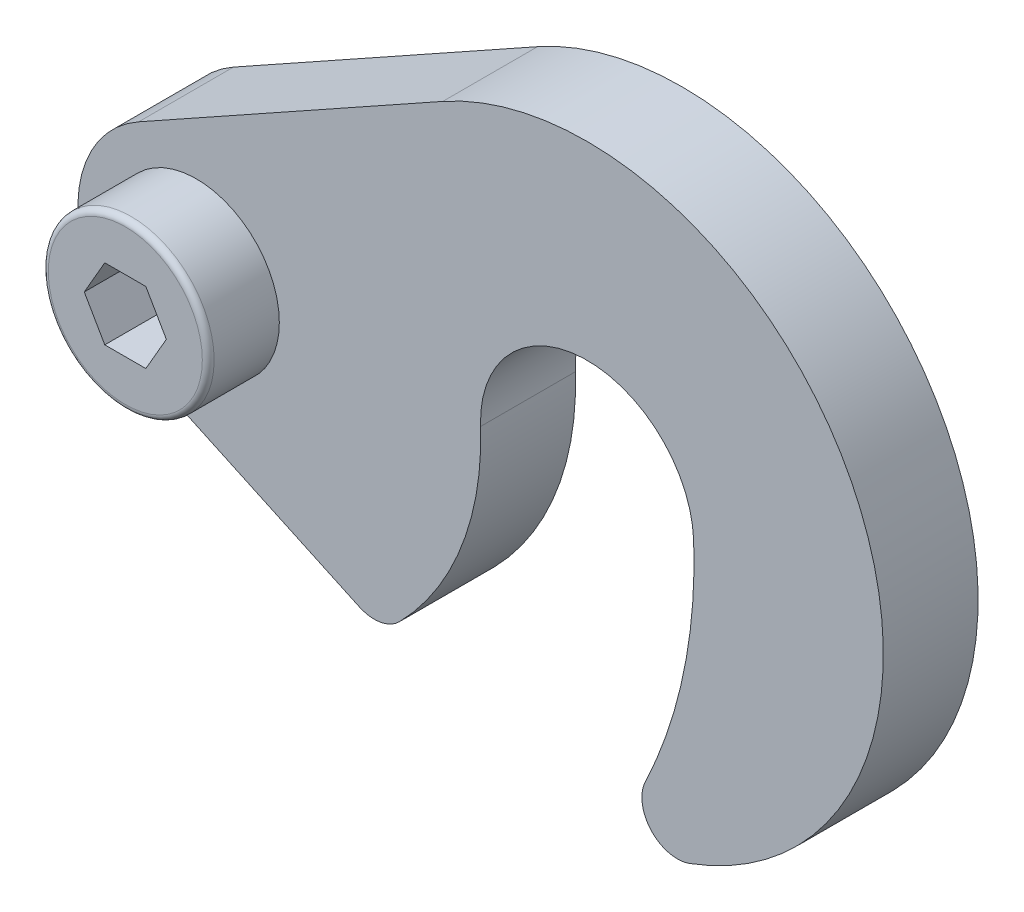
ISO-10303-21;
HEADER;
FILE_DESCRIPTION(('STEP AP214'),'2;1');
FILE_NAME('part.step','',(''),(''),'','','');
FILE_SCHEMA(('AUTOMOTIVE_DESIGN { 1 0 10303 214 1 1 1 1 }'));
ENDSEC;
DATA;
#1=APPLICATION_CONTEXT('core data for automotive mechanical design processes');
#2=APPLICATION_PROTOCOL_DEFINITION('international standard','automotive_design',2000,#1);
#3=PRODUCT_CONTEXT('',#1,'mechanical');
#4=PRODUCT('Part','Part','',(#3));
#5=PRODUCT_RELATED_PRODUCT_CATEGORY('part','',(#4));
#6=PRODUCT_DEFINITION_FORMATION('','',#4);
#7=PRODUCT_DEFINITION_CONTEXT('part definition',#1,'design');
#8=PRODUCT_DEFINITION('design','',#6,#7);
#9=PRODUCT_DEFINITION_SHAPE('','',#8);
#10=(LENGTH_UNIT() NAMED_UNIT(*) SI_UNIT(.MILLI.,.METRE.));
#11=(NAMED_UNIT(*) PLANE_ANGLE_UNIT() SI_UNIT($,.RADIAN.));
#12=(NAMED_UNIT(*) SI_UNIT($,.STERADIAN.) SOLID_ANGLE_UNIT());
#13=UNCERTAINTY_MEASURE_WITH_UNIT(LENGTH_MEASURE(1.E-05),#10,'distance_accuracy_value','');
#14=(GEOMETRIC_REPRESENTATION_CONTEXT(3) GLOBAL_UNCERTAINTY_ASSIGNED_CONTEXT((#13)) GLOBAL_UNIT_ASSIGNED_CONTEXT((#10,
#11,#12)) REPRESENTATION_CONTEXT('',''));
#15=CARTESIAN_POINT('',(0.,0.,0.));
#16=DIRECTION('',(0.,0.,1.));
#17=DIRECTION('',(1.,0.,0.));
#18=AXIS2_PLACEMENT_3D('',#15,#16,#17);
#19=CARTESIAN_POINT('',(0.,0.,1.));
#20=DIRECTION('',(0.,0.,1.));
#21=DIRECTION('',(0.,-1.,0.));
#22=AXIS2_PLACEMENT_3D('',#19,#20,#21);
#23=PLANE('',#22);
#24=CARTESIAN_POINT('',(0.,0.,1.));
#25=DIRECTION('',(0.,0.,-1.));
#26=DIRECTION('',(0.,1.,0.));
#27=AXIS2_PLACEMENT_3D('',#24,#25,#26);
#28=CIRCLE('',#27,5.25);
#29=CARTESIAN_POINT('',(0.,5.25,1.));
#30=VERTEX_POINT('',#29);
#31=EDGE_CURVE('E179',#30,#30,#28,.T.);
#32=ORIENTED_EDGE('',*,*,#31,.F.);
#33=EDGE_LOOP('',(#32));
#34=FACE_BOUND('',#33,.T.);
#35=CARTESIAN_POINT('',(0.,0.,1.));
#36=DIRECTION('',(0.,0.,1.));
#37=DIRECTION('',(0.,-1.,0.));
#38=AXIS2_PLACEMENT_3D('',#35,#36,#37);
#39=CIRCLE('',#38,42.);
#40=CARTESIAN_POINT('',(37.8913046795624,-18.1176441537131,1.));
#41=VERTEX_POINT('',#40);
#42=CARTESIAN_POINT('',(41.9709947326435,1.5606412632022,1.));
#43=VERTEX_POINT('',#42);
#44=EDGE_CURVE('E193',#41,#43,#39,.T.);
#45=ORIENTED_EDGE('',*,*,#44,.T.);
#46=CARTESIAN_POINT('',(32.9772101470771,1.22621813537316,1.));
#47=DIRECTION('',(0.,0.,1.));
#48=DIRECTION('',(0.,-1.,0.));
#49=AXIS2_PLACEMENT_3D('',#46,#47,#48);
#50=CIRCLE('',#49,9.);
#51=CARTESIAN_POINT('',(23.9834255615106,0.891795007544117,1.));
#52=VERTEX_POINT('',#51);
#53=EDGE_CURVE('E198',#43,#52,#50,.T.);
#54=ORIENTED_EDGE('',*,*,#53,.T.);
#55=CARTESIAN_POINT('',(0.,0.,1.));
#56=DIRECTION('',(0.,0.,1.));
#57=DIRECTION('',(0.,-1.,0.));
#58=AXIS2_PLACEMENT_3D('',#55,#56,#57);
#59=CIRCLE('',#58,24.);
#60=CARTESIAN_POINT('',(17.1539610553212,-16.7851607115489,1.));
#61=VERTEX_POINT('',#60);
#62=EDGE_CURVE('E201',#61,#52,#59,.T.);
#63=ORIENTED_EDGE('',*,*,#62,.F.);
#64=CARTESIAN_POINT('',(15.0097159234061,-14.6870156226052,1.));
#65=DIRECTION('',(0.,0.,1.));
#66=DIRECTION('',(0.,-1.,0.));
#67=AXIS2_PLACEMENT_3D('',#64,#65,#66);
#68=CIRCLE('',#67,3.);
#69=CARTESIAN_POINT('',(13.746314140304,-17.4080110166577,1.));
#70=VERTEX_POINT('',#69);
#71=EDGE_CURVE('E204',#70,#61,#68,.T.);
#72=ORIENTED_EDGE('',*,*,#71,.F.);
#73=DIRECTION('',(-0.906998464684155,0.421133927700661,0.));
#74=VECTOR('',#73,1.);
#75=CARTESIAN_POINT('',(13.746314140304,-17.4080110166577,1.));
#76=LINE('',#75,#74);
#77=CARTESIAN_POINT('',(-4.21133927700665,-9.06998464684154,1.));
#78=VERTEX_POINT('',#77);
#79=EDGE_CURVE('E207',#70,#78,#76,.T.);
#80=ORIENTED_EDGE('',*,*,#79,.T.);
#81=CARTESIAN_POINT('',(0.,0.,1.));
#82=DIRECTION('',(0.,0.,1.));
#83=DIRECTION('',(0.,-1.,0.));
#84=AXIS2_PLACEMENT_3D('',#81,#82,#83);
#85=CIRCLE('',#84,10.);
#86=CARTESIAN_POINT('',(-4.87329161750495,8.7321835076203,1.));
#87=VERTEX_POINT('',#86);
#88=EDGE_CURVE('E210',#87,#78,#85,.T.);
#89=ORIENTED_EDGE('',*,*,#88,.F.);
#90=DIRECTION('',(0.873218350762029,0.487329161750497,0.));
#91=VECTOR('',#90,1.);
#92=CARTESIAN_POINT('',(-4.87329161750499,8.73218350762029,1.));
#93=LINE('',#92,#91);
#94=CARTESIAN_POINT('',(20.7939811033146,23.0566769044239,1.));
#95=VERTEX_POINT('',#94);
#96=EDGE_CURVE('E213',#87,#95,#93,.T.);
#97=ORIENTED_EDGE('',*,*,#96,.T.);
#98=CARTESIAN_POINT('',(32.9772101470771,1.22621813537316,1.));
#99=DIRECTION('',(0.,0.,1.));
#100=DIRECTION('',(0.,-1.,0.));
#101=AXIS2_PLACEMENT_3D('',#98,#99,#100);
#102=CIRCLE('',#101,25.);
#103=CARTESIAN_POINT('',(41.6370013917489,-22.22603155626,1.));
#104=VERTEX_POINT('',#103);
#105=EDGE_CURVE('E216',#104,#95,#102,.T.);
#106=ORIENTED_EDGE('',*,*,#105,.F.);
#107=CARTESIAN_POINT('',(40.5978264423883,-19.411761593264,1.));
#108=DIRECTION('',(0.,0.,-1.));
#109=DIRECTION('',(0.,1.,0.));
#110=AXIS2_PLACEMENT_3D('',#107,#108,#109);
#111=CIRCLE('',#110,3.);
#112=EDGE_CURVE('E219',#104,#41,#111,.T.);
#113=ORIENTED_EDGE('',*,*,#112,.T.);
#114=EDGE_LOOP('',(#45,#54,#63,#72,#80,#89,#97,#106,#113));
#115=FACE_BOUND('',#114,.T.);
#116=ADVANCED_FACE('F14',(#34,#115),#23,.F.);
#117=CARTESIAN_POINT('',(0.,0.,9.));
#118=DIRECTION('',(0.,0.,-1.));
#119=DIRECTION('',(0.,1.,0.));
#120=AXIS2_PLACEMENT_3D('',#117,#118,#119);
#121=CYLINDRICAL_SURFACE('',#120,42.);
#122=DIRECTION('',(0.,0.,-1.));
#123=VECTOR('',#122,1.);
#124=CARTESIAN_POINT('',(37.8913046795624,-18.1176441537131,9.));
#125=LINE('',#124,#123);
#126=CARTESIAN_POINT('',(37.8913046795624,-18.1176441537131,9.));
#127=VERTEX_POINT('',#126);
#128=EDGE_CURVE('E37',#127,#41,#125,.T.);
#129=ORIENTED_EDGE('',*,*,#128,.F.);
#130=CARTESIAN_POINT('',(0.,0.,9.));
#131=DIRECTION('',(0.,0.,1.));
#132=DIRECTION('',(0.,-1.,0.));
#133=AXIS2_PLACEMENT_3D('',#130,#131,#132);
#134=CIRCLE('',#133,42.);
#135=CARTESIAN_POINT('',(41.9709947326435,1.5606412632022,9.));
#136=VERTEX_POINT('',#135);
#137=EDGE_CURVE('E222',#127,#136,#134,.T.);
#138=ORIENTED_EDGE('',*,*,#137,.T.);
#139=DIRECTION('',(0.,0.,-1.));
#140=VECTOR('',#139,1.);
#141=CARTESIAN_POINT('',(41.9709947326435,1.5606412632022,9.));
#142=LINE('',#141,#140);
#143=EDGE_CURVE('E248',#136,#43,#142,.T.);
#144=ORIENTED_EDGE('',*,*,#143,.T.);
#145=ORIENTED_EDGE('',*,*,#44,.F.);
#146=EDGE_LOOP('',(#129,#138,#144,#145));
#147=FACE_BOUND('',#146,.T.);
#148=ADVANCED_FACE('F284',(#147),#121,.F.);
#149=CARTESIAN_POINT('',(40.5978264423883,-19.411761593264,9.));
#150=DIRECTION('',(0.,0.,-1.));
#151=DIRECTION('',(0.,1.,0.));
#152=AXIS2_PLACEMENT_3D('',#149,#150,#151);
#153=CYLINDRICAL_SURFACE('',#152,3.);
#154=DIRECTION('',(0.,0.,-1.));
#155=VECTOR('',#154,1.);
#156=CARTESIAN_POINT('',(41.6370013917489,-22.22603155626,9.));
#157=LINE('',#156,#155);
#158=CARTESIAN_POINT('',(41.6370013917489,-22.22603155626,9.));
#159=VERTEX_POINT('',#158);
#160=EDGE_CURVE('E262',#159,#104,#157,.T.);
#161=ORIENTED_EDGE('',*,*,#160,.F.);
#162=CARTESIAN_POINT('',(40.5978264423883,-19.411761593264,9.));
#163=DIRECTION('',(0.,0.,-1.));
#164=DIRECTION('',(0.,1.,0.));
#165=AXIS2_PLACEMENT_3D('',#162,#163,#164);
#166=CIRCLE('',#165,3.);
#167=EDGE_CURVE('E245',#159,#127,#166,.T.);
#168=ORIENTED_EDGE('',*,*,#167,.T.);
#169=ORIENTED_EDGE('',*,*,#128,.T.);
#170=ORIENTED_EDGE('',*,*,#112,.F.);
#171=EDGE_LOOP('',(#161,#168,#169,#170));
#172=FACE_BOUND('',#171,.T.);
#173=ADVANCED_FACE('F291',(#172),#153,.T.);
#174=CARTESIAN_POINT('',(32.9772101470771,1.22621813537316,9.));
#175=DIRECTION('',(0.,0.,-1.));
#176=DIRECTION('',(0.,1.,0.));
#177=AXIS2_PLACEMENT_3D('',#174,#175,#176);
#178=CYLINDRICAL_SURFACE('',#177,25.);
#179=DIRECTION('',(0.,0.,-1.));
#180=VECTOR('',#179,1.);
#181=CARTESIAN_POINT('',(20.7939811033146,23.0566769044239,9.));
#182=LINE('',#181,#180);
#183=CARTESIAN_POINT('',(20.7939811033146,23.0566769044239,9.));
#184=VERTEX_POINT('',#183);
#185=EDGE_CURVE('E260',#184,#95,#182,.T.);
#186=ORIENTED_EDGE('',*,*,#185,.F.);
#187=CARTESIAN_POINT('',(32.9772101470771,1.22621813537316,9.));
#188=DIRECTION('',(0.,0.,1.));
#189=DIRECTION('',(0.,-1.,0.));
#190=AXIS2_PLACEMENT_3D('',#187,#188,#189);
#191=CIRCLE('',#190,25.);
#192=EDGE_CURVE('E242',#159,#184,#191,.T.);
#193=ORIENTED_EDGE('',*,*,#192,.F.);
#194=ORIENTED_EDGE('',*,*,#160,.T.);
#195=ORIENTED_EDGE('',*,*,#105,.T.);
#196=EDGE_LOOP('',(#186,#193,#194,#195));
#197=FACE_BOUND('',#196,.T.);
#198=ADVANCED_FACE('F327',(#197),#178,.T.);
#199=CARTESIAN_POINT('',(-4.87329161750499,8.73218350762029,9.));
#200=DIRECTION('',(-0.487329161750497,0.873218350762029,0.));
#201=DIRECTION('',(-0.873218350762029,-0.487329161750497,0.));
#202=AXIS2_PLACEMENT_3D('',#199,#200,#201);
#203=PLANE('',#202);
#204=DIRECTION('',(0.,0.,-1.));
#205=VECTOR('',#204,1.);
#206=CARTESIAN_POINT('',(-4.87329161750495,8.7321835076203,9.));
#207=LINE('',#206,#205);
#208=CARTESIAN_POINT('',(-4.87329161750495,8.7321835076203,9.));
#209=VERTEX_POINT('',#208);
#210=EDGE_CURVE('E258',#209,#87,#207,.T.);
#211=ORIENTED_EDGE('',*,*,#210,.F.);
#212=DIRECTION('',(0.873218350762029,0.487329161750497,0.));
#213=VECTOR('',#212,1.);
#214=CARTESIAN_POINT('',(-4.87329161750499,8.73218350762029,9.));
#215=LINE('',#214,#213);
#216=EDGE_CURVE('E239',#209,#184,#215,.T.);
#217=ORIENTED_EDGE('',*,*,#216,.T.);
#218=ORIENTED_EDGE('',*,*,#185,.T.);
#219=ORIENTED_EDGE('',*,*,#96,.F.);
#220=EDGE_LOOP('',(#211,#217,#218,#219));
#221=FACE_BOUND('',#220,.T.);
#222=ADVANCED_FACE('F323',(#221),#203,.T.);
#223=CARTESIAN_POINT('',(0.,0.,9.));
#224=DIRECTION('',(0.,0.,-1.));
#225=DIRECTION('',(0.,1.,0.));
#226=AXIS2_PLACEMENT_3D('',#223,#224,#225);
#227=CYLINDRICAL_SURFACE('',#226,10.);
#228=DIRECTION('',(0.,0.,-1.));
#229=VECTOR('',#228,1.);
#230=CARTESIAN_POINT('',(-4.21133927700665,-9.06998464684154,9.));
#231=LINE('',#230,#229);
#232=CARTESIAN_POINT('',(-4.21133927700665,-9.06998464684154,9.));
#233=VERTEX_POINT('',#232);
#234=EDGE_CURVE('E256',#233,#78,#231,.T.);
#235=ORIENTED_EDGE('',*,*,#234,.F.);
#236=CARTESIAN_POINT('',(0.,0.,9.));
#237=DIRECTION('',(0.,0.,1.));
#238=DIRECTION('',(0.,-1.,0.));
#239=AXIS2_PLACEMENT_3D('',#236,#237,#238);
#240=CIRCLE('',#239,10.);
#241=EDGE_CURVE('E236',#209,#233,#240,.T.);
#242=ORIENTED_EDGE('',*,*,#241,.F.);
#243=ORIENTED_EDGE('',*,*,#210,.T.);
#244=ORIENTED_EDGE('',*,*,#88,.T.);
#245=EDGE_LOOP('',(#235,#242,#243,#244));
#246=FACE_BOUND('',#245,.T.);
#247=ADVANCED_FACE('F319',(#246),#227,.T.);
#248=CARTESIAN_POINT('',(13.746314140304,-17.4080110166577,9.));
#249=DIRECTION('',(-0.421133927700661,-0.906998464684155,0.));
#250=DIRECTION('',(0.906998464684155,-0.421133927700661,0.));
#251=AXIS2_PLACEMENT_3D('',#248,#249,#250);
#252=PLANE('',#251);
#253=DIRECTION('',(0.,0.,-1.));
#254=VECTOR('',#253,1.);
#255=CARTESIAN_POINT('',(13.746314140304,-17.4080110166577,9.));
#256=LINE('',#255,#254);
#257=CARTESIAN_POINT('',(13.746314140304,-17.4080110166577,9.));
#258=VERTEX_POINT('',#257);
#259=EDGE_CURVE('E254',#258,#70,#256,.T.);
#260=ORIENTED_EDGE('',*,*,#259,.F.);
#261=DIRECTION('',(-0.906998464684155,0.421133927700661,0.));
#262=VECTOR('',#261,1.);
#263=CARTESIAN_POINT('',(13.746314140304,-17.4080110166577,9.));
#264=LINE('',#263,#262);
#265=EDGE_CURVE('E233',#258,#233,#264,.T.);
#266=ORIENTED_EDGE('',*,*,#265,.T.);
#267=ORIENTED_EDGE('',*,*,#234,.T.);
#268=ORIENTED_EDGE('',*,*,#79,.F.);
#269=EDGE_LOOP('',(#260,#266,#267,#268));
#270=FACE_BOUND('',#269,.T.);
#271=ADVANCED_FACE('F315',(#270),#252,.T.);
#272=CARTESIAN_POINT('',(15.0097159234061,-14.6870156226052,9.));
#273=DIRECTION('',(0.,0.,-1.));
#274=DIRECTION('',(0.,1.,0.));
#275=AXIS2_PLACEMENT_3D('',#272,#273,#274);
#276=CYLINDRICAL_SURFACE('',#275,3.);
#277=DIRECTION('',(0.,0.,-1.));
#278=VECTOR('',#277,1.);
#279=CARTESIAN_POINT('',(17.1539610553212,-16.7851607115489,9.));
#280=LINE('',#279,#278);
#281=CARTESIAN_POINT('',(17.1539610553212,-16.7851607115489,9.));
#282=VERTEX_POINT('',#281);
#283=EDGE_CURVE('E252',#282,#61,#280,.T.);
#284=ORIENTED_EDGE('',*,*,#283,.F.);
#285=CARTESIAN_POINT('',(15.0097159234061,-14.6870156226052,9.));
#286=DIRECTION('',(0.,0.,1.));
#287=DIRECTION('',(0.,-1.,0.));
#288=AXIS2_PLACEMENT_3D('',#285,#286,#287);
#289=CIRCLE('',#288,3.);
#290=EDGE_CURVE('E230',#258,#282,#289,.T.);
#291=ORIENTED_EDGE('',*,*,#290,.F.);
#292=ORIENTED_EDGE('',*,*,#259,.T.);
#293=ORIENTED_EDGE('',*,*,#71,.T.);
#294=EDGE_LOOP('',(#284,#291,#292,#293));
#295=FACE_BOUND('',#294,.T.);
#296=ADVANCED_FACE('F311',(#295),#276,.T.);
#297=CARTESIAN_POINT('',(0.,0.,9.));
#298=DIRECTION('',(0.,0.,-1.));
#299=DIRECTION('',(0.,1.,0.));
#300=AXIS2_PLACEMENT_3D('',#297,#298,#299);
#301=CYLINDRICAL_SURFACE('',#300,24.);
#302=DIRECTION('',(0.,0.,-1.));
#303=VECTOR('',#302,1.);
#304=CARTESIAN_POINT('',(23.9834255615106,0.891795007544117,9.));
#305=LINE('',#304,#303);
#306=CARTESIAN_POINT('',(23.9834255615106,0.891795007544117,9.));
#307=VERTEX_POINT('',#306);
#308=EDGE_CURVE('E250',#307,#52,#305,.T.);
#309=ORIENTED_EDGE('',*,*,#308,.F.);
#310=CARTESIAN_POINT('',(0.,0.,9.));
#311=DIRECTION('',(0.,0.,1.));
#312=DIRECTION('',(0.,-1.,0.));
#313=AXIS2_PLACEMENT_3D('',#310,#311,#312);
#314=CIRCLE('',#313,24.);
#315=EDGE_CURVE('E227',#282,#307,#314,.T.);
#316=ORIENTED_EDGE('',*,*,#315,.F.);
#317=ORIENTED_EDGE('',*,*,#283,.T.);
#318=ORIENTED_EDGE('',*,*,#62,.T.);
#319=EDGE_LOOP('',(#309,#316,#317,#318));
#320=FACE_BOUND('',#319,.T.);
#321=ADVANCED_FACE('F303',(#320),#301,.T.);
#322=CARTESIAN_POINT('',(32.9772101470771,1.22621813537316,9.));
#323=DIRECTION('',(0.,0.,-1.));
#324=DIRECTION('',(0.,1.,0.));
#325=AXIS2_PLACEMENT_3D('',#322,#323,#324);
#326=CYLINDRICAL_SURFACE('',#325,9.);
#327=CARTESIAN_POINT('',(32.9772101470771,1.22621813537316,9.));
#328=DIRECTION('',(0.,0.,1.));
#329=DIRECTION('',(0.,-1.,0.));
#330=AXIS2_PLACEMENT_3D('',#327,#328,#329);
#331=CIRCLE('',#330,9.);
#332=EDGE_CURVE('E224',#136,#307,#331,.T.);
#333=ORIENTED_EDGE('',*,*,#332,.T.);
#334=ORIENTED_EDGE('',*,*,#308,.T.);
#335=ORIENTED_EDGE('',*,*,#53,.F.);
#336=ORIENTED_EDGE('',*,*,#143,.F.);
#337=EDGE_LOOP('',(#333,#334,#335,#336));
#338=FACE_BOUND('',#337,.T.);
#339=ADVANCED_FACE('F301',(#338),#326,.F.);
#340=CARTESIAN_POINT('',(0.,0.,9.));
#341=DIRECTION('',(0.,0.,1.));
#342=DIRECTION('',(0.,-1.,0.));
#343=AXIS2_PLACEMENT_3D('',#340,#341,#342);
#344=PLANE('',#343);
#345=CARTESIAN_POINT('',(0.,0.,9.));
#346=DIRECTION('',(0.,0.,1.));
#347=DIRECTION('',(0.,-1.,0.));
#348=AXIS2_PLACEMENT_3D('',#345,#346,#347);
#349=CIRCLE('',#348,7.);
#350=CARTESIAN_POINT('',(0.,-7.,9.));
#351=VERTEX_POINT('',#350);
#352=EDGE_CURVE('E190',#351,#351,#349,.T.);
#353=ORIENTED_EDGE('',*,*,#352,.F.);
#354=EDGE_LOOP('',(#353));
#355=FACE_BOUND('',#354,.T.);
#356=ORIENTED_EDGE('',*,*,#137,.F.);
#357=ORIENTED_EDGE('',*,*,#167,.F.);
#358=ORIENTED_EDGE('',*,*,#192,.T.);
#359=ORIENTED_EDGE('',*,*,#216,.F.);
#360=ORIENTED_EDGE('',*,*,#241,.T.);
#361=ORIENTED_EDGE('',*,*,#265,.F.);
#362=ORIENTED_EDGE('',*,*,#290,.T.);
#363=ORIENTED_EDGE('',*,*,#315,.T.);
#364=ORIENTED_EDGE('',*,*,#332,.F.);
#365=EDGE_LOOP('',(#356,#357,#358,#359,#360,#361,#362,#363,#364));
#366=FACE_BOUND('',#365,.T.);
#367=ADVANCED_FACE('F299',(#355,#366),#344,.T.);
#368=CARTESIAN_POINT('',(0.,0.,15.));
#369=DIRECTION('',(0.,0.,-1.));
#370=DIRECTION('',(0.,1.,0.));
#371=AXIS2_PLACEMENT_3D('',#368,#369,#370);
#372=CYLINDRICAL_SURFACE('',#371,7.);
#373=CARTESIAN_POINT('',(0.,0.,14.5));
#374=DIRECTION('',(0.,0.,1.));
#375=DIRECTION('',(1.,0.,0.));
#376=AXIS2_PLACEMENT_3D('',#373,#374,#375);
#377=CIRCLE('',#376,7.);
#378=CARTESIAN_POINT('',(7.,0.,14.5));
#379=VERTEX_POINT('',#378);
#380=EDGE_CURVE('E267',#379,#379,#377,.F.);
#381=ORIENTED_EDGE('',*,*,#380,.T.);
#382=EDGE_LOOP('',(#381));
#383=FACE_BOUND('',#382,.T.);
#384=ORIENTED_EDGE('',*,*,#352,.T.);
#385=EDGE_LOOP('',(#384));
#386=FACE_BOUND('',#385,.T.);
#387=ADVANCED_FACE('F297',(#383,#386),#372,.T.);
#388=CARTESIAN_POINT('',(0.,0.,15.));
#389=DIRECTION('',(0.,0.,1.));
#390=DIRECTION('',(0.,-1.,0.));
#391=AXIS2_PLACEMENT_3D('',#388,#389,#390);
#392=PLANE('',#391);
#393=DIRECTION('',(0.5,0.866025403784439,0.));
#394=VECTOR('',#393,1.);
#395=CARTESIAN_POINT('',(1.73205080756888,-3.,15.));
#396=LINE('',#395,#394);
#397=CARTESIAN_POINT('',(1.73205080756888,-3.,15.));
#398=VERTEX_POINT('',#397);
#399=CARTESIAN_POINT('',(3.46410161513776,0.,15.));
#400=VERTEX_POINT('',#399);
#401=EDGE_CURVE('E29',#398,#400,#396,.T.);
#402=ORIENTED_EDGE('',*,*,#401,.F.);
#403=DIRECTION('',(1.,0.,0.));
#404=VECTOR('',#403,1.);
#405=CARTESIAN_POINT('',(-1.73205080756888,-3.,15.));
#406=LINE('',#405,#404);
#407=CARTESIAN_POINT('',(-1.73205080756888,-3.,15.));
#408=VERTEX_POINT('',#407);
#409=EDGE_CURVE('E143',#408,#398,#406,.T.);
#410=ORIENTED_EDGE('',*,*,#409,.F.);
#411=DIRECTION('',(0.5,-0.866025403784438,0.));
#412=VECTOR('',#411,1.);
#413=CARTESIAN_POINT('',(-3.46410161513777,0.,15.));
#414=LINE('',#413,#412);
#415=CARTESIAN_POINT('',(-3.46410161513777,0.,15.));
#416=VERTEX_POINT('',#415);
#417=EDGE_CURVE('E146',#416,#408,#414,.T.);
#418=ORIENTED_EDGE('',*,*,#417,.F.);
#419=DIRECTION('',(-0.5,-0.866025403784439,0.));
#420=VECTOR('',#419,1.);
#421=CARTESIAN_POINT('',(-1.73205080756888,3.,15.));
#422=LINE('',#421,#420);
#423=CARTESIAN_POINT('',(-1.73205080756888,3.,15.));
#424=VERTEX_POINT('',#423);
#425=EDGE_CURVE('E162',#424,#416,#422,.T.);
#426=ORIENTED_EDGE('',*,*,#425,.F.);
#427=DIRECTION('',(-1.,0.,0.));
#428=VECTOR('',#427,1.);
#429=CARTESIAN_POINT('',(1.73205080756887,3.,15.));
#430=LINE('',#429,#428);
#431=CARTESIAN_POINT('',(1.73205080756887,3.,15.));
#432=VERTEX_POINT('',#431);
#433=EDGE_CURVE('E159',#432,#424,#430,.T.);
#434=ORIENTED_EDGE('',*,*,#433,.F.);
#435=DIRECTION('',(-0.5,0.866025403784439,0.));
#436=VECTOR('',#435,1.);
#437=CARTESIAN_POINT('',(3.46410161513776,0.,15.));
#438=LINE('',#437,#436);
#439=EDGE_CURVE('E157',#400,#432,#438,.T.);
#440=ORIENTED_EDGE('',*,*,#439,.F.);
#441=EDGE_LOOP('',(#402,#410,#418,#426,#434,#440));
#442=FACE_BOUND('',#441,.T.);
#443=CARTESIAN_POINT('',(0.,0.,15.));
#444=DIRECTION('',(0.,0.,1.));
#445=DIRECTION('',(1.,0.,0.));
#446=AXIS2_PLACEMENT_3D('',#443,#444,#445);
#447=CIRCLE('',#446,6.5);
#448=CARTESIAN_POINT('',(6.5,0.,15.));
#449=VERTEX_POINT('',#448);
#450=EDGE_CURVE('E189',#449,#449,#447,.T.);
#451=ORIENTED_EDGE('',*,*,#450,.T.);
#452=EDGE_LOOP('',(#451));
#453=FACE_BOUND('',#452,.T.);
#454=ADVANCED_FACE('F308',(#442,#453),#392,.T.);
#455=CARTESIAN_POINT('',(0.,0.,9.));
#456=DIRECTION('',(0.,0.,-1.));
#457=DIRECTION('',(0.,1.,0.));
#458=AXIS2_PLACEMENT_3D('',#455,#456,#457);
#459=CYLINDRICAL_SURFACE('',#458,5.25);
#460=CARTESIAN_POINT('',(0.,0.,9.));
#461=DIRECTION('',(0.,0.,-1.));
#462=DIRECTION('',(0.,1.,0.));
#463=AXIS2_PLACEMENT_3D('',#460,#461,#462);
#464=CIRCLE('',#463,5.25);
#465=CARTESIAN_POINT('',(0.,5.25,9.));
#466=VERTEX_POINT('',#465);
#467=EDGE_CURVE('E182',#466,#466,#464,.T.);
#468=ORIENTED_EDGE('',*,*,#467,.F.);
#469=EDGE_LOOP('',(#468));
#470=FACE_BOUND('',#469,.T.);
#471=ORIENTED_EDGE('',*,*,#31,.T.);
#472=EDGE_LOOP('',(#471));
#473=FACE_BOUND('',#472,.T.);
#474=ADVANCED_FACE('F353',(#470,#473),#459,.F.);
#475=CARTESIAN_POINT('',(0.,0.,9.));
#476=DIRECTION('',(0.,0.,-1.));
#477=DIRECTION('',(0.,1.,0.));
#478=AXIS2_PLACEMENT_3D('',#475,#476,#477);
#479=PLANE('',#478);
#480=CARTESIAN_POINT('',(0.,0.,9.));
#481=DIRECTION('',(0.,0.,-1.));
#482=DIRECTION('',(0.,1.,0.));
#483=AXIS2_PLACEMENT_3D('',#480,#481,#482);
#484=CIRCLE('',#483,5.);
#485=CARTESIAN_POINT('',(0.,5.,9.));
#486=VERTEX_POINT('',#485);
#487=EDGE_CURVE('E169',#486,#486,#484,.T.);
#488=ORIENTED_EDGE('',*,*,#487,.F.);
#489=EDGE_LOOP('',(#488));
#490=FACE_BOUND('',#489,.T.);
#491=ORIENTED_EDGE('',*,*,#467,.T.);
#492=EDGE_LOOP('',(#491));
#493=FACE_BOUND('',#492,.T.);
#494=ADVANCED_FACE('F360',(#490,#493),#479,.T.);
#495=CARTESIAN_POINT('',(0.,0.,-11.));
#496=DIRECTION('',(0.,0.,-1.));
#497=DIRECTION('',(0.,1.,0.));
#498=AXIS2_PLACEMENT_3D('',#495,#496,#497);
#499=PLANE('',#498);
#500=CARTESIAN_POINT('',(0.,0.,-11.));
#501=DIRECTION('',(0.,0.,-1.));
#502=DIRECTION('',(-1.,0.,0.));
#503=AXIS2_PLACEMENT_3D('',#500,#501,#502);
#504=CIRCLE('',#503,2.8);
#505=CARTESIAN_POINT('',(-2.8,0.,-11.));
#506=VERTEX_POINT('',#505);
#507=EDGE_CURVE('E22',#506,#506,#504,.T.);
#508=ORIENTED_EDGE('',*,*,#507,.T.);
#509=EDGE_LOOP('',(#508));
#510=FACE_BOUND('',#509,.T.);
#511=ADVANCED_FACE('F272',(#510),#499,.T.);
#512=CARTESIAN_POINT('',(0.,0.,-11.));
#513=DIRECTION('',(0.,0.,1.));
#514=DIRECTION('',(0.,-1.,0.));
#515=AXIS2_PLACEMENT_3D('',#512,#513,#514);
#516=CYLINDRICAL_SURFACE('',#515,4.);
#517=CARTESIAN_POINT('',(0.,0.,-9.8));
#518=DIRECTION('',(0.,0.,-1.));
#519=DIRECTION('',(-1.,0.,0.));
#520=AXIS2_PLACEMENT_3D('',#517,#518,#519);
#521=CIRCLE('',#520,4.);
#522=CARTESIAN_POINT('',(-4.,0.,-9.8));
#523=VERTEX_POINT('',#522);
#524=EDGE_CURVE('E9',#523,#523,#521,.F.);
#525=ORIENTED_EDGE('',*,*,#524,.T.);
#526=EDGE_LOOP('',(#525));
#527=FACE_BOUND('',#526,.T.);
#528=CARTESIAN_POINT('',(0.,0.,0.));
#529=DIRECTION('',(0.,0.,-1.));
#530=DIRECTION('',(0.,1.,0.));
#531=AXIS2_PLACEMENT_3D('',#528,#529,#530);
#532=CIRCLE('',#531,4.);
#533=CARTESIAN_POINT('',(0.,4.,0.));
#534=VERTEX_POINT('',#533);
#535=EDGE_CURVE('E186',#534,#534,#532,.T.);
#536=ORIENTED_EDGE('',*,*,#535,.T.);
#537=EDGE_LOOP('',(#536));
#538=FACE_BOUND('',#537,.T.);
#539=ADVANCED_FACE('F367',(#527,#538),#516,.T.);
#540=CARTESIAN_POINT('',(0.,0.,0.));
#541=DIRECTION('',(0.,0.,-1.));
#542=DIRECTION('',(0.,1.,0.));
#543=AXIS2_PLACEMENT_3D('',#540,#541,#542);
#544=PLANE('',#543);
#545=ORIENTED_EDGE('',*,*,#535,.F.);
#546=EDGE_LOOP('',(#545));
#547=FACE_BOUND('',#546,.T.);
#548=CARTESIAN_POINT('',(0.,0.,0.));
#549=DIRECTION('',(0.,0.,-1.));
#550=DIRECTION('',(0.,1.,0.));
#551=AXIS2_PLACEMENT_3D('',#548,#549,#550);
#552=CIRCLE('',#551,5.);
#553=CARTESIAN_POINT('',(0.,5.,0.));
#554=VERTEX_POINT('',#553);
#555=EDGE_CURVE('E185',#554,#554,#552,.T.);
#556=ORIENTED_EDGE('',*,*,#555,.T.);
#557=EDGE_LOOP('',(#556));
#558=FACE_BOUND('',#557,.T.);
#559=ADVANCED_FACE('F345',(#547,#558),#544,.T.);
#560=CARTESIAN_POINT('',(0.,0.,0.));
#561=DIRECTION('',(0.,0.,1.));
#562=DIRECTION('',(0.,-1.,0.));
#563=AXIS2_PLACEMENT_3D('',#560,#561,#562);
#564=CYLINDRICAL_SURFACE('',#563,5.);
#565=ORIENTED_EDGE('',*,*,#555,.F.);
#566=EDGE_LOOP('',(#565));
#567=FACE_BOUND('',#566,.T.);
#568=ORIENTED_EDGE('',*,*,#487,.T.);
#569=EDGE_LOOP('',(#568));
#570=FACE_BOUND('',#569,.T.);
#571=ADVANCED_FACE('F336',(#567,#570),#564,.T.);
#572=CARTESIAN_POINT('',(0.,0.,14.5));
#573=DIRECTION('',(0.,0.,1.));
#574=DIRECTION('',(1.,0.,0.));
#575=AXIS2_PLACEMENT_3D('',#572,#573,#574);
#576=TOROIDAL_SURFACE('',#575,6.5,0.5);
#577=ORIENTED_EDGE('',*,*,#380,.F.);
#578=EDGE_LOOP('',(#577));
#579=FACE_BOUND('',#578,.T.);
#580=ORIENTED_EDGE('',*,*,#450,.F.);
#581=EDGE_LOOP('',(#580));
#582=FACE_BOUND('',#581,.T.);
#583=ADVANCED_FACE('F334',(#579,#582),#576,.T.);
#584=CARTESIAN_POINT('',(1.73205080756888,-3.,10.5));
#585=DIRECTION('',(0.866025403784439,-0.5,0.));
#586=DIRECTION('',(0.5,0.866025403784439,0.));
#587=AXIS2_PLACEMENT_3D('',#584,#585,#586);
#588=PLANE('',#587);
#589=ORIENTED_EDGE('',*,*,#401,.T.);
#590=DIRECTION('',(0.,0.,1.));
#591=VECTOR('',#590,1.);
#592=CARTESIAN_POINT('',(3.46410161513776,0.,10.5));
#593=LINE('',#592,#591);
#594=CARTESIAN_POINT('',(3.46410161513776,0.,10.5));
#595=VERTEX_POINT('',#594);
#596=EDGE_CURVE('E120',#595,#400,#593,.T.);
#597=ORIENTED_EDGE('',*,*,#596,.F.);
#598=DIRECTION('',(0.5,0.866025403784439,0.));
#599=VECTOR('',#598,1.);
#600=CARTESIAN_POINT('',(1.73205080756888,-3.,10.5));
#601=LINE('',#600,#599);
#602=CARTESIAN_POINT('',(1.73205080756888,-3.,10.5));
#603=VERTEX_POINT('',#602);
#604=EDGE_CURVE('E124',#603,#595,#601,.T.);
#605=ORIENTED_EDGE('',*,*,#604,.F.);
#606=DIRECTION('',(0.,0.,1.));
#607=VECTOR('',#606,1.);
#608=CARTESIAN_POINT('',(1.73205080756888,-3.,10.5));
#609=LINE('',#608,#607);
#610=EDGE_CURVE('E167',#603,#398,#609,.T.);
#611=ORIENTED_EDGE('',*,*,#610,.T.);
#612=EDGE_LOOP('',(#589,#597,#605,#611));
#613=FACE_BOUND('',#612,.T.);
#614=ADVANCED_FACE('F122',(#613),#588,.F.);
#615=CARTESIAN_POINT('',(-1.73205080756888,-3.,10.5));
#616=DIRECTION('',(0.,-1.,0.));
#617=DIRECTION('',(1.,0.,0.));
#618=AXIS2_PLACEMENT_3D('',#615,#616,#617);
#619=PLANE('',#618);
#620=ORIENTED_EDGE('',*,*,#409,.T.);
#621=ORIENTED_EDGE('',*,*,#610,.F.);
#622=DIRECTION('',(1.,0.,0.));
#623=VECTOR('',#622,1.);
#624=CARTESIAN_POINT('',(-1.73205080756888,-3.,10.5));
#625=LINE('',#624,#623);
#626=CARTESIAN_POINT('',(-1.73205080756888,-3.,10.5));
#627=VERTEX_POINT('',#626);
#628=EDGE_CURVE('E130',#627,#603,#625,.T.);
#629=ORIENTED_EDGE('',*,*,#628,.F.);
#630=DIRECTION('',(0.,0.,1.));
#631=VECTOR('',#630,1.);
#632=CARTESIAN_POINT('',(-1.73205080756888,-3.,10.5));
#633=LINE('',#632,#631);
#634=EDGE_CURVE('E170',#627,#408,#633,.T.);
#635=ORIENTED_EDGE('',*,*,#634,.T.);
#636=EDGE_LOOP('',(#620,#621,#629,#635));
#637=FACE_BOUND('',#636,.T.);
#638=ADVANCED_FACE('F343',(#637),#619,.F.);
#639=CARTESIAN_POINT('',(-3.46410161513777,0.,10.5));
#640=DIRECTION('',(-0.866025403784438,-0.5,0.));
#641=DIRECTION('',(0.5,-0.866025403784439,0.));
#642=AXIS2_PLACEMENT_3D('',#639,#640,#641);
#643=PLANE('',#642);
#644=ORIENTED_EDGE('',*,*,#417,.T.);
#645=ORIENTED_EDGE('',*,*,#634,.F.);
#646=DIRECTION('',(0.5,-0.866025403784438,0.));
#647=VECTOR('',#646,1.);
#648=CARTESIAN_POINT('',(-3.46410161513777,0.,10.5));
#649=LINE('',#648,#647);
#650=CARTESIAN_POINT('',(-3.46410161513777,0.,10.5));
#651=VERTEX_POINT('',#650);
#652=EDGE_CURVE('E153',#651,#627,#649,.T.);
#653=ORIENTED_EDGE('',*,*,#652,.F.);
#654=DIRECTION('',(0.,0.,1.));
#655=VECTOR('',#654,1.);
#656=CARTESIAN_POINT('',(-3.46410161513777,0.,10.5));
#657=LINE('',#656,#655);
#658=EDGE_CURVE('E172',#651,#416,#657,.T.);
#659=ORIENTED_EDGE('',*,*,#658,.T.);
#660=EDGE_LOOP('',(#644,#645,#653,#659));
#661=FACE_BOUND('',#660,.T.);
#662=ADVANCED_FACE('F386',(#661),#643,.F.);
#663=CARTESIAN_POINT('',(-1.73205080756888,3.,10.5));
#664=DIRECTION('',(-0.866025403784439,0.5,0.));
#665=DIRECTION('',(-0.5,-0.866025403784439,0.));
#666=AXIS2_PLACEMENT_3D('',#663,#664,#665);
#667=PLANE('',#666);
#668=ORIENTED_EDGE('',*,*,#425,.T.);
#669=ORIENTED_EDGE('',*,*,#658,.F.);
#670=DIRECTION('',(-0.5,-0.866025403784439,0.));
#671=VECTOR('',#670,1.);
#672=CARTESIAN_POINT('',(-1.73205080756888,3.,10.5));
#673=LINE('',#672,#671);
#674=CARTESIAN_POINT('',(-1.73205080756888,3.,10.5));
#675=VERTEX_POINT('',#674);
#676=EDGE_CURVE('E150',#675,#651,#673,.T.);
#677=ORIENTED_EDGE('',*,*,#676,.F.);
#678=DIRECTION('',(0.,0.,1.));
#679=VECTOR('',#678,1.);
#680=CARTESIAN_POINT('',(-1.73205080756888,3.,10.5));
#681=LINE('',#680,#679);
#682=EDGE_CURVE('E174',#675,#424,#681,.T.);
#683=ORIENTED_EDGE('',*,*,#682,.T.);
#684=EDGE_LOOP('',(#668,#669,#677,#683));
#685=FACE_BOUND('',#684,.T.);
#686=ADVANCED_FACE('F382',(#685),#667,.F.);
#687=CARTESIAN_POINT('',(1.73205080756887,3.,10.5));
#688=DIRECTION('',(0.,1.,0.));
#689=DIRECTION('',(-1.,0.,0.));
#690=AXIS2_PLACEMENT_3D('',#687,#688,#689);
#691=PLANE('',#690);
#692=ORIENTED_EDGE('',*,*,#433,.T.);
#693=ORIENTED_EDGE('',*,*,#682,.F.);
#694=DIRECTION('',(-1.,0.,0.));
#695=VECTOR('',#694,1.);
#696=CARTESIAN_POINT('',(1.73205080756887,3.,10.5));
#697=LINE('',#696,#695);
#698=CARTESIAN_POINT('',(1.73205080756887,3.,10.5));
#699=VERTEX_POINT('',#698);
#700=EDGE_CURVE('E138',#699,#675,#697,.T.);
#701=ORIENTED_EDGE('',*,*,#700,.F.);
#702=DIRECTION('',(0.,0.,1.));
#703=VECTOR('',#702,1.);
#704=CARTESIAN_POINT('',(1.73205080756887,3.,10.5));
#705=LINE('',#704,#703);
#706=EDGE_CURVE('E129',#699,#432,#705,.T.);
#707=ORIENTED_EDGE('',*,*,#706,.T.);
#708=EDGE_LOOP('',(#692,#693,#701,#707));
#709=FACE_BOUND('',#708,.T.);
#710=ADVANCED_FACE('F379',(#709),#691,.F.);
#711=CARTESIAN_POINT('',(3.46410161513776,0.,10.5));
#712=DIRECTION('',(0.866025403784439,0.5,0.));
#713=DIRECTION('',(-0.5,0.866025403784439,0.));
#714=AXIS2_PLACEMENT_3D('',#711,#712,#713);
#715=PLANE('',#714);
#716=ORIENTED_EDGE('',*,*,#439,.T.);
#717=ORIENTED_EDGE('',*,*,#706,.F.);
#718=DIRECTION('',(-0.5,0.866025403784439,0.));
#719=VECTOR('',#718,1.);
#720=CARTESIAN_POINT('',(3.46410161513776,0.,10.5));
#721=LINE('',#720,#719);
#722=EDGE_CURVE('E133',#595,#699,#721,.T.);
#723=ORIENTED_EDGE('',*,*,#722,.F.);
#724=ORIENTED_EDGE('',*,*,#596,.T.);
#725=EDGE_LOOP('',(#716,#717,#723,#724));
#726=FACE_BOUND('',#725,.T.);
#727=ADVANCED_FACE('F134',(#726),#715,.F.);
#728=CARTESIAN_POINT('',(3.46410161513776,0.,10.5));
#729=DIRECTION('',(0.,0.,1.));
#730=DIRECTION('',(1.,0.,0.));
#731=AXIS2_PLACEMENT_3D('',#728,#729,#730);
#732=PLANE('',#731);
#733=ORIENTED_EDGE('',*,*,#604,.T.);
#734=ORIENTED_EDGE('',*,*,#722,.T.);
#735=ORIENTED_EDGE('',*,*,#700,.T.);
#736=ORIENTED_EDGE('',*,*,#676,.T.);
#737=ORIENTED_EDGE('',*,*,#652,.T.);
#738=ORIENTED_EDGE('',*,*,#628,.T.);
#739=EDGE_LOOP('',(#733,#734,#735,#736,#737,#738));
#740=FACE_BOUND('',#739,.T.);
#741=ADVANCED_FACE('F140',(#740),#732,.T.);
#742=CARTESIAN_POINT('',(0.,0.,-11.));
#743=DIRECTION('',(0.,0.,1.));
#744=DIRECTION('',(1.,0.,0.));
#745=AXIS2_PLACEMENT_3D('',#742,#743,#744);
#746=CONICAL_SURFACE('',#745,2.8,0.785398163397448);
#747=ORIENTED_EDGE('',*,*,#524,.F.);
#748=EDGE_LOOP('',(#747));
#749=FACE_BOUND('',#748,.T.);
#750=ORIENTED_EDGE('',*,*,#507,.F.);
#751=EDGE_LOOP('',(#750));
#752=FACE_BOUND('',#751,.T.);
#753=ADVANCED_FACE('F16',(#749,#752),#746,.T.);
#754=CLOSED_SHELL('',(#116,#148,#173,#198,#222,#247,#271,#296,#321,#339,#367,#387,#454,#474,
#494,#511,#539,#559,#571,#583,#614,#638,#662,#686,#710,#727,#741,#753));
#755=MANIFOLD_SOLID_BREP('B1',#754);
#756=ADVANCED_BREP_SHAPE_REPRESENTATION('',(#18,#755),#14);
#757=SHAPE_DEFINITION_REPRESENTATION(#9,#756);
ENDSEC;
END-ISO-10303-21;
